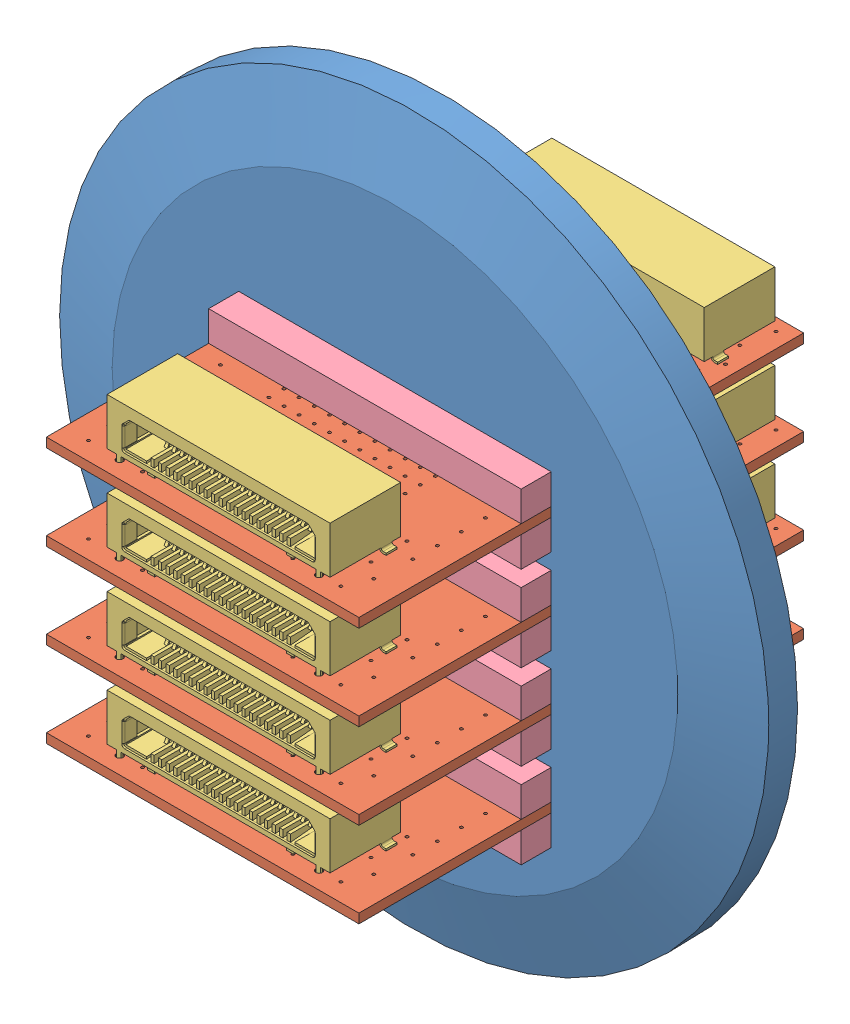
SolidWorks assembly Vacuum_Feedthrough.SLDASM, configuration Default (file format 9000). Lengths in mm.
Overall size (74.93 74.93 49.53).
25 component instances, 4 part files, 36 mates.
Components (placement in the parent):
- KF50_Flange-1: KF50_Flange.SLDPRT [Default] at (26.8515 41.9202 56.1909) size (74.93 74.93 5.08)
- Ingress05-1: Ingress05.SLDASM [Default] at (42.1315 52.4616 32.8109) x (-1 0 0) z (0 1 0) size (33.02 49.53 6.8)
  - Board_ingress05_solid-1: Board_ingress05_solid.sldprt [Default] at origin size (33.02 49.53 0.99)
  - FCS8-20-01-L-S-A-TR-1: FCS8-20-01-L-S-A-TR.sldprt [Default] at (15.26 -2.42 0.45) x (1 0 0) z (0 -1 0) size (24.59 6.8 8.45)
  - FCS8-20-01-L-S-A-TR-2: FCS8-20-01-L-S-A-TR.sldprt [Default] at (15.3 44.54 0.45) x (-1 0 0) z (0 1 0) size (24.59 6.8 8.45)
- Ingress05-2: Ingress05.SLDASM [Default] at (42.1315 43.4446 32.8109) x (-1 0 0) z (0 1 0) size (33.02 49.53 6.8)
  - Board_ingress05_solid-1: Board_ingress05_solid.sldprt [Default] at origin size (33.02 49.53 0.99)
  - FCS8-20-01-L-S-A-TR-1: FCS8-20-01-L-S-A-TR.sldprt [Default] at (15.26 -2.42 0.45) x (1 0 0) z (0 -1 0) size (24.59 6.8 8.45)
  - FCS8-20-01-L-S-A-TR-2: FCS8-20-01-L-S-A-TR.sldprt [Default] at (15.3 44.54 0.45) x (-1 0 0) z (0 1 0) size (24.59 6.8 8.45)
- Ingress05-3: Ingress05.SLDASM [Default] at (42.1315 34.4276 32.8109) x (-1 0 0) z (0 1 0) size (33.02 49.53 6.8)
  - Board_ingress05_solid-1: Board_ingress05_solid.sldprt [Default] at origin size (33.02 49.53 0.99)
  - FCS8-20-01-L-S-A-TR-1: FCS8-20-01-L-S-A-TR.sldprt [Default] at (15.26 -2.42 0.45) x (1 0 0) z (0 -1 0) size (24.59 6.8 8.45)
  - FCS8-20-01-L-S-A-TR-2: FCS8-20-01-L-S-A-TR.sldprt [Default] at (15.3 44.54 0.45) x (-1 0 0) z (0 1 0) size (24.59 6.8 8.45)
- Ingress05-4: Ingress05.SLDASM [Default] at (42.1315 25.4106 32.8109) x (-1 0 0) z (0 1 0) size (33.02 49.53 6.8)
  - Board_ingress05_solid-1: Board_ingress05_solid.sldprt [Default] at origin size (33.02 49.53 0.99)
  - FCS8-20-01-L-S-A-TR-1: FCS8-20-01-L-S-A-TR.sldprt [Default] at (15.26 -2.42 0.45) x (1 0 0) z (0 -1 0) size (24.59 6.8 8.45)
  - FCS8-20-01-L-S-A-TR-2: FCS8-20-01-L-S-A-TR.sldprt [Default] at (15.3 44.54 0.45) x (-1 0 0) z (0 1 0) size (24.59 6.8 8.45)
- Brass_Rod-1: Brass_Rod.SLDPRT [Default] at (10.3415 52.4616 61.9059) size (33.02 3.17 3.17)
- Brass_Rod-2: Brass_Rod.SLDPRT [Default] at (10.3415 48.2956 61.9059) size (33.02 3.17 3.17)
- Brass_Rod-3: Brass_Rod.SLDPRT [Default] at (10.3415 43.4446 61.9059) size (33.02 3.17 3.17)
- Brass_Rod-4: Brass_Rod.SLDPRT [Default] at (10.3415 39.2786 61.9059) size (33.02 3.17 3.17)
- Brass_Rod-5: Brass_Rod.SLDPRT [Default] at (10.3415 34.4276 61.9059) size (33.02 3.17 3.17)
- Brass_Rod-6: Brass_Rod.SLDPRT [Default] at (10.3415 30.2616 61.9059) size (33.02 3.17 3.17)
- Brass_Rod-7: Brass_Rod.SLDPRT [Default] at (10.3415 25.4106 61.9059) size (33.02 3.17 3.17)
- Brass_Rod-8: Brass_Rod.SLDPRT [Default] at (10.3415 21.2446 61.9059) size (33.02 3.17 3.17)
Mates (geometry in assembly coordinates):
- Coincident1: coincident anti-aligned: plane of KF50_Flange-1 through (12.3481 51.4706 53.6509) normal (0 1 0); plane of Ingress05-1/Board_ingress05_solid-1 through (42.1315 51.4706 32.8109) normal (0 -1 0)
- Distance1: distance = 0.5334 mm: line of Ingress05-1/Board_ingress05_solid-1 through (12.8815 52.4616 29.5209) axis (0 0 1); plane of KF50_Flange-1 through (12.3481 53.0454 53.6509) normal (1 0 0)
- Coincident3: coincident anti-aligned: plane of KF50_Flange-1 through (26.8515 41.9202 58.7309) normal (0 0 1); plane of Ingress05-1/Board_ingress05_solid-1 through (43.3615 51.4706 58.7309) normal (0 0 -1)
- Coincident5: coincident anti-aligned: plane of KF50_Flange-1 through (12.3481 42.4536 53.6509) normal (0 1 0); plane of Ingress05-2/Board_ingress05_solid-1 through (42.1315 42.4536 32.8109) normal (0 -1 0)
- Distance2: distance = 0.5334 mm anti-aligned: plane of Ingress05-2/Board_ingress05_solid-1 through (12.8815 42.4536 29.5209) normal (-1 0 0); plane of KF50_Flange-1 through (12.3481 44.0284 53.6509) normal (1 0 0)
- Coincident7: coincident anti-aligned: plane of KF50_Flange-1 through (26.8515 41.9202 58.7309) normal (0 0 1); plane of Ingress05-2/Board_ingress05_solid-1 through (12.8815 42.4536 58.7309) normal (0 0 -1)
- Distance3: distance = 0.5334 mm anti-aligned: plane of KF50_Flange-1 through (12.3481 35.0114 53.6509) normal (1 0 0); plane of Ingress05-3/Board_ingress05_solid-1 through (12.8815 33.4366 29.5209) normal (-1 0 0)
- Coincident9: coincident anti-aligned: plane of KF50_Flange-1 through (12.3481 33.4366 53.6509) normal (0 1 0); plane of Ingress05-3/Board_ingress05_solid-1 through (42.1315 33.4366 32.8109) normal (0 -1 0)
- Coincident11: coincident anti-aligned: plane of KF50_Flange-1 through (26.8515 41.9202 58.7309) normal (0 0 1); plane of Ingress05-3/Board_ingress05_solid-1 through (43.3615 33.4366 58.7309) normal (0 0 -1)
- Distance4: distance = 0.5334 mm anti-aligned: plane of KF50_Flange-1 through (12.3481 25.9944 53.6509) normal (1 0 0); plane of Ingress05-4/Board_ingress05_solid-1 through (12.8815 24.4196 29.5209) normal (-1 0 0)
- Coincident13: coincident anti-aligned: plane of KF50_Flange-1 through (12.3481 24.4196 53.6509) normal (0 1 0); plane of Ingress05-4/Board_ingress05_solid-1 through (42.1315 24.4196 32.8109) normal (0 -1 0)
- Coincident14: coincident anti-aligned: plane of KF50_Flange-1 through (26.8515 41.9202 58.7309) normal (0 0 1); plane of Ingress05-4/Board_ingress05_solid-1 through (43.3615 24.4196 58.7309) normal (0 0 -1)
- Coincident15: coincident anti-aligned: plane of KF50_Flange-1 through (26.8515 41.9202 58.7309) normal (0 0 1); plane of Brass_Rod-1 through (10.3415 55.6366 58.7309) normal (0 0 -1)
- Coincident16: coincident anti-aligned: plane of KF50_Flange-1 through (26.8515 41.9202 58.7309) normal (0 0 1); plane of Brass_Rod-2 through (10.3415 51.4706 58.7309) normal (0 0 -1)
- Coincident17: coincident anti-aligned: plane of KF50_Flange-1 through (26.8515 41.9202 58.7309) normal (0 0 1); plane of Brass_Rod-3 through (10.3415 46.6196 58.7309) normal (0 0 -1)
- Coincident18: coincident anti-aligned: plane of KF50_Flange-1 through (26.8515 41.9202 58.7309) normal (0 0 1); plane of Brass_Rod-4 through (10.3415 42.4536 58.7309) normal (0 0 -1)
- Coincident19: coincident anti-aligned: plane of KF50_Flange-1 through (26.8515 41.9202 58.7309) normal (0 0 1); plane of Brass_Rod-5 through (10.3415 37.6026 58.7309) normal (0 0 -1)
- Coincident20: coincident anti-aligned: plane of KF50_Flange-1 through (26.8515 41.9202 58.7309) normal (0 0 1); plane of Brass_Rod-6 through (10.3415 33.4366 58.7309) normal (0 0 -1)
- Coincident21: coincident anti-aligned: plane of KF50_Flange-1 through (26.8515 41.9202 58.7309) normal (0 0 1); plane of Brass_Rod-7 through (10.3415 28.5856 58.7309) normal (0 0 -1)
- Coincident22: coincident anti-aligned: plane of KF50_Flange-1 through (26.8515 41.9202 58.7309) normal (0 0 1); plane of Brass_Rod-8 through (10.3415 24.4196 58.7309) normal (0 0 -1)
- Coincident23: coincident aligned: plane of Ingress05-1/Board_ingress05_solid-1 through (10.3415 51.4706 58.7309) normal (-1 0 0); plane of Brass_Rod-1 through (10.3415 55.6366 61.9059) normal (-1 0 0)
- Coincident24: coincident aligned: plane of Ingress05-1/Board_ingress05_solid-1 through (10.3415 51.4706 58.7309) normal (-1 0 0); plane of Brass_Rod-2 through (10.3415 51.4706 61.9059) normal (-1 0 0)
- Coincident25: coincident aligned: plane of Ingress05-2/Board_ingress05_solid-1 through (10.3415 42.4536 58.7309) normal (-1 0 0); plane of Brass_Rod-3 through (10.3415 46.6196 61.9059) normal (-1 0 0)
- Coincident26: coincident aligned: plane of Ingress05-2/Board_ingress05_solid-1 through (10.3415 42.4536 58.7309) normal (-1 0 0); plane of Brass_Rod-4 through (10.3415 42.4536 61.9059) normal (-1 0 0)
- Coincident27: coincident aligned: plane of Ingress05-3/Board_ingress05_solid-1 through (10.3415 33.4366 58.7309) normal (-1 0 0); plane of Brass_Rod-5 through (10.3415 37.6026 61.9059) normal (-1 0 0)
- Coincident28: coincident aligned: plane of Ingress05-3/Board_ingress05_solid-1 through (10.3415 33.4366 58.7309) normal (-1 0 0); plane of Brass_Rod-6 through (10.3415 33.4366 61.9059) normal (-1 0 0)
- Coincident29: coincident: line of Ingress05-4/Board_ingress05_solid-1 through (10.3415 24.4196 58.7309) axis (0 0 1); plane of Brass_Rod-7 through (10.3415 28.5856 61.9059) normal (-1 0 0)
- Coincident30: coincident: line of Ingress05-4/Board_ingress05_solid-1 through (10.3415 25.4106 58.7309) axis (0 0 1); plane of Brass_Rod-8 through (10.3415 24.4196 61.9059) normal (-1 0 0)
- Coincident32: coincident anti-aligned: plane of Ingress05-1/Board_ingress05_solid-1 through (42.1315 51.4706 32.8109) normal (0 -1 0); plane of Brass_Rod-2 through (10.3415 51.4706 61.9059) normal (0 1 0)
- Coincident33: coincident anti-aligned: plane of Ingress05-2/Board_ingress05_solid-1 through (42.1315 42.4536 32.8109) normal (0 -1 0); plane of Brass_Rod-4 through (10.3415 42.4536 61.9059) normal (0 1 0)
- Coincident34: coincident anti-aligned: plane of Ingress05-3/Board_ingress05_solid-1 through (42.1315 34.4276 32.8109) normal (0 1 0); plane of Brass_Rod-5 through (10.3415 34.4276 61.9059) normal (0 -1 0)
- Coincident35: coincident anti-aligned: plane of Ingress05-3/Board_ingress05_solid-1 through (42.1315 33.4366 32.8109) normal (0 -1 0); plane of Brass_Rod-6 through (10.3415 33.4366 61.9059) normal (0 1 0)
- Coincident36: coincident anti-aligned: plane of Ingress05-4/Board_ingress05_solid-1 through (42.1315 25.4106 32.8109) normal (0 1 0); plane of Brass_Rod-7 through (10.3415 25.4106 61.9059) normal (0 -1 0)
- Coincident37: coincident anti-aligned: plane of Ingress05-4/Board_ingress05_solid-1 through (42.1315 24.4196 32.8109) normal (0 -1 0); plane of Brass_Rod-8 through (10.3415 24.4196 61.9059) normal (0 1 0)
- Coincident38: coincident anti-aligned: plane of Ingress05-1/Board_ingress05_solid-1 through (42.1315 52.4616 32.8109) normal (0 1 0); plane of Brass_Rod-1 through (10.3415 52.4616 61.9059) normal (0 -1 0)
- Coincident39: coincident anti-aligned: plane of Ingress05-2/Board_ingress05_solid-1 through (42.1315 43.4446 32.8109) normal (0 1 0); plane of Brass_Rod-3 through (10.3415 43.4446 61.9059) normal (0 -1 0)
